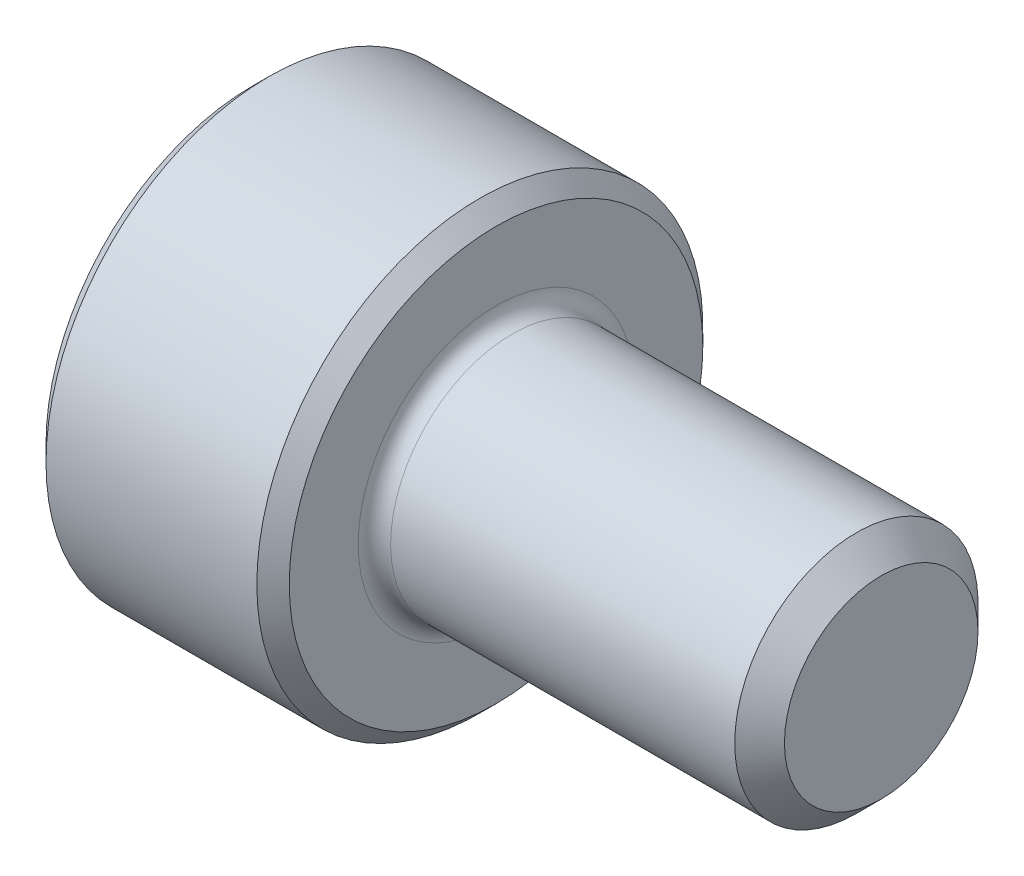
ISO-10303-21;
HEADER;
FILE_DESCRIPTION(('STEP AP214'),'2;1');
FILE_NAME('part.step','',(''),(''),'','','');
FILE_SCHEMA(('AUTOMOTIVE_DESIGN { 1 0 10303 214 1 1 1 1 }'));
ENDSEC;
DATA;
#1=APPLICATION_CONTEXT('core data for automotive mechanical design processes');
#2=APPLICATION_PROTOCOL_DEFINITION('international standard','automotive_design',2000,#1);
#3=PRODUCT_CONTEXT('',#1,'mechanical');
#4=PRODUCT('Part','Part','',(#3));
#5=PRODUCT_RELATED_PRODUCT_CATEGORY('part','',(#4));
#6=PRODUCT_DEFINITION_FORMATION('','',#4);
#7=PRODUCT_DEFINITION_CONTEXT('part definition',#1,'design');
#8=PRODUCT_DEFINITION('design','',#6,#7);
#9=PRODUCT_DEFINITION_SHAPE('','',#8);
#10=(LENGTH_UNIT() NAMED_UNIT(*) SI_UNIT(.MILLI.,.METRE.));
#11=(NAMED_UNIT(*) PLANE_ANGLE_UNIT() SI_UNIT($,.RADIAN.));
#12=(NAMED_UNIT(*) SI_UNIT($,.STERADIAN.) SOLID_ANGLE_UNIT());
#13=UNCERTAINTY_MEASURE_WITH_UNIT(LENGTH_MEASURE(1.E-05),#10,'distance_accuracy_value','');
#14=(GEOMETRIC_REPRESENTATION_CONTEXT(3) GLOBAL_UNCERTAINTY_ASSIGNED_CONTEXT((#13)) GLOBAL_UNIT_ASSIGNED_CONTEXT((#10,
#11,#12)) REPRESENTATION_CONTEXT('',''));
#15=CARTESIAN_POINT('',(0.,0.,0.));
#16=DIRECTION('',(0.,0.,1.));
#17=DIRECTION('',(1.,0.,0.));
#18=AXIS2_PLACEMENT_3D('',#15,#16,#17);
#19=CARTESIAN_POINT('',(7.75,1.1935,0.));
#20=DIRECTION('',(-1.,0.,0.));
#21=DIRECTION('',(0.,0.,1.));
#22=AXIS2_PLACEMENT_3D('',#19,#20,#21);
#23=PLANE('',#22);
#24=CARTESIAN_POINT('',(7.75000000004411,0.,0.));
#25=DIRECTION('',(-1.,0.,0.));
#26=DIRECTION('',(0.,-1.,0.));
#27=AXIS2_PLACEMENT_3D('',#24,#25,#26);
#28=CIRCLE('',#27,1.1934999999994);
#29=CARTESIAN_POINT('',(7.75000000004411,-1.1934999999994,0.));
#30=VERTEX_POINT('',#29);
#31=EDGE_CURVE('E175',#30,#30,#28,.T.);
#32=ORIENTED_EDGE('',*,*,#31,.F.);
#33=EDGE_LOOP('',(#32));
#34=FACE_BOUND('',#33,.T.);
#35=ADVANCED_FACE('F17',(#34),#23,.F.);
#36=CARTESIAN_POINT('',(7.44350000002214,0.,0.));
#37=DIRECTION('',(-1.,0.,0.));
#38=DIRECTION('',(0.,-1.,0.));
#39=AXIS2_PLACEMENT_3D('',#36,#37,#38);
#40=CONICAL_SURFACE('',#39,1.50000000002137,0.785398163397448);
#41=CARTESIAN_POINT('',(7.4435,0.,0.));
#42=DIRECTION('',(-1.,0.,0.));
#43=DIRECTION('',(0.,0.,1.));
#44=AXIS2_PLACEMENT_3D('',#41,#42,#43);
#45=CIRCLE('',#44,1.5);
#46=CARTESIAN_POINT('',(7.4435,0.,1.5));
#47=VERTEX_POINT('',#46);
#48=EDGE_CURVE('E172',#47,#47,#45,.T.);
#49=ORIENTED_EDGE('',*,*,#48,.F.);
#50=EDGE_LOOP('',(#49));
#51=FACE_BOUND('',#50,.T.);
#52=ORIENTED_EDGE('',*,*,#31,.T.);
#53=EDGE_LOOP('',(#52));
#54=FACE_BOUND('',#53,.T.);
#55=ADVANCED_FACE('F186',(#51,#54),#40,.T.);
#56=CARTESIAN_POINT('',(7.75,0.,0.));
#57=DIRECTION('',(-1.,0.,0.));
#58=DIRECTION('',(0.,0.,1.));
#59=AXIS2_PLACEMENT_3D('',#56,#57,#58);
#60=CYLINDRICAL_SURFACE('',#59,1.5);
#61=CARTESIAN_POINT('',(3.2,0.,0.));
#62=DIRECTION('',(-1.,0.,0.));
#63=DIRECTION('',(0.,0.,1.));
#64=AXIS2_PLACEMENT_3D('',#61,#62,#63);
#65=CIRCLE('',#64,1.5);
#66=CARTESIAN_POINT('',(3.2,0.,1.5));
#67=VERTEX_POINT('',#66);
#68=EDGE_CURVE('E151',#67,#67,#65,.F.);
#69=ORIENTED_EDGE('',*,*,#68,.T.);
#70=EDGE_LOOP('',(#69));
#71=FACE_BOUND('',#70,.T.);
#72=ORIENTED_EDGE('',*,*,#48,.T.);
#73=EDGE_LOOP('',(#72));
#74=FACE_BOUND('',#73,.T.);
#75=ADVANCED_FACE('F193',(#71,#74),#60,.T.);
#76=CARTESIAN_POINT('',(1.3,0.,0.));
#77=DIRECTION('',(1.,0.,0.));
#78=DIRECTION('',(0.,0.,-1.));
#79=AXIS2_PLACEMENT_3D('',#76,#77,#78);
#80=PLANE('',#79);
#81=DIRECTION('',(0.,-0.5,-0.866025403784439));
#82=VECTOR('',#81,1.);
#83=CARTESIAN_POINT('',(1.3,0.721687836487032,-1.25));
#84=LINE('',#83,#82);
#85=CARTESIAN_POINT('',(1.3,0.721687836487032,-1.25));
#86=VERTEX_POINT('',#85);
#87=CARTESIAN_POINT('',(1.3,1.44337567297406,0.));
#88=VERTEX_POINT('',#87);
#89=EDGE_CURVE('E150',#86,#88,#84,.F.);
#90=ORIENTED_EDGE('',*,*,#89,.F.);
#91=DIRECTION('',(0.,1.,0.));
#92=VECTOR('',#91,1.);
#93=CARTESIAN_POINT('',(1.3,-0.721687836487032,-1.25));
#94=LINE('',#93,#92);
#95=CARTESIAN_POINT('',(1.3,-0.721687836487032,-1.25));
#96=VERTEX_POINT('',#95);
#97=EDGE_CURVE('E147',#96,#86,#94,.T.);
#98=ORIENTED_EDGE('',*,*,#97,.F.);
#99=DIRECTION('',(0.,-0.5,0.866025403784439));
#100=VECTOR('',#99,1.);
#101=CARTESIAN_POINT('',(1.3,-1.44337567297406,0.));
#102=LINE('',#101,#100);
#103=CARTESIAN_POINT('',(1.3,-1.44337567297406,0.));
#104=VERTEX_POINT('',#103);
#105=EDGE_CURVE('E141',#104,#96,#102,.F.);
#106=ORIENTED_EDGE('',*,*,#105,.F.);
#107=DIRECTION('',(0.,0.5,0.866025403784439));
#108=VECTOR('',#107,1.);
#109=CARTESIAN_POINT('',(1.3,-0.721687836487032,1.25));
#110=LINE('',#109,#108);
#111=CARTESIAN_POINT('',(1.3,-0.721687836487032,1.25));
#112=VERTEX_POINT('',#111);
#113=EDGE_CURVE('E135',#112,#104,#110,.F.);
#114=ORIENTED_EDGE('',*,*,#113,.F.);
#115=DIRECTION('',(0.,1.,0.));
#116=VECTOR('',#115,1.);
#117=CARTESIAN_POINT('',(1.3,0.721687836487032,1.25));
#118=LINE('',#117,#116);
#119=CARTESIAN_POINT('',(1.3,0.721687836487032,1.25));
#120=VERTEX_POINT('',#119);
#121=EDGE_CURVE('E129',#120,#112,#118,.F.);
#122=ORIENTED_EDGE('',*,*,#121,.F.);
#123=DIRECTION('',(0.,0.5,-0.866025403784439));
#124=VECTOR('',#123,1.);
#125=CARTESIAN_POINT('',(1.3,1.44337567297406,0.));
#126=LINE('',#125,#124);
#127=EDGE_CURVE('E121',#88,#120,#126,.F.);
#128=ORIENTED_EDGE('',*,*,#127,.F.);
#129=EDGE_LOOP('',(#90,#98,#106,#114,#122,#128));
#130=FACE_BOUND('',#129,.T.);
#131=ADVANCED_FACE('F158',(#130),#80,.F.);
#132=CARTESIAN_POINT('',(3.2,0.,0.));
#133=DIRECTION('',(-1.,0.,0.));
#134=DIRECTION('',(0.,0.,1.));
#135=AXIS2_PLACEMENT_3D('',#132,#133,#134);
#136=TOROIDAL_SURFACE('',#135,1.7,0.2);
#137=CARTESIAN_POINT('',(3.,0.,0.));
#138=DIRECTION('',(1.,0.,0.));
#139=DIRECTION('',(0.,0.,-1.));
#140=AXIS2_PLACEMENT_3D('',#137,#138,#139);
#141=CIRCLE('',#140,1.7);
#142=CARTESIAN_POINT('',(3.,0.,-1.7));
#143=VERTEX_POINT('',#142);
#144=CARTESIAN_POINT('',(3.,0.,1.7));
#145=VERTEX_POINT('',#144);
#146=EDGE_CURVE('E78',#143,#145,#141,.T.);
#147=ORIENTED_EDGE('',*,*,#146,.T.);
#148=CARTESIAN_POINT('',(3.,0.,0.));
#149=DIRECTION('',(1.,0.,0.));
#150=DIRECTION('',(0.,0.,1.));
#151=AXIS2_PLACEMENT_3D('',#148,#149,#150);
#152=CIRCLE('',#151,1.7);
#153=EDGE_CURVE('E76',#145,#143,#152,.T.);
#154=ORIENTED_EDGE('',*,*,#153,.T.);
#155=EDGE_LOOP('',(#147,#154));
#156=FACE_BOUND('',#155,.T.);
#157=ORIENTED_EDGE('',*,*,#68,.F.);
#158=EDGE_LOOP('',(#157));
#159=FACE_BOUND('',#158,.T.);
#160=ADVANCED_FACE('F80',(#156,#159),#136,.F.);
#161=CARTESIAN_POINT('',(1.3,0.721687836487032,-1.25));
#162=DIRECTION('',(0.,-0.866025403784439,0.5));
#163=DIRECTION('',(0.,-0.5,-0.866025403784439));
#164=AXIS2_PLACEMENT_3D('',#161,#162,#163);
#165=PLANE('',#164);
#166=ORIENTED_EDGE('',*,*,#89,.T.);
#167=DIRECTION('',(1.,0.,0.));
#168=VECTOR('',#167,1.);
#169=CARTESIAN_POINT('',(1.3,1.44337567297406,0.));
#170=LINE('',#169,#168);
#171=CARTESIAN_POINT('',(0.,1.44337567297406,0.));
#172=VERTEX_POINT('',#171);
#173=EDGE_CURVE('E124',#172,#88,#170,.T.);
#174=ORIENTED_EDGE('',*,*,#173,.F.);
#175=DIRECTION('',(0.,-0.5,-0.866025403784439));
#176=VECTOR('',#175,1.);
#177=CARTESIAN_POINT('',(0.,1.44337567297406,0.));
#178=LINE('',#177,#176);
#179=CARTESIAN_POINT('',(0.,0.721687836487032,-1.25));
#180=VERTEX_POINT('',#179);
#181=EDGE_CURVE('E84',#172,#180,#178,.T.);
#182=ORIENTED_EDGE('',*,*,#181,.T.);
#183=DIRECTION('',(1.,0.,0.));
#184=VECTOR('',#183,1.);
#185=CARTESIAN_POINT('',(1.3,0.721687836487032,-1.25));
#186=LINE('',#185,#184);
#187=EDGE_CURVE('E144',#86,#180,#186,.F.);
#188=ORIENTED_EDGE('',*,*,#187,.F.);
#189=EDGE_LOOP('',(#166,#174,#182,#188));
#190=FACE_BOUND('',#189,.T.);
#191=ADVANCED_FACE('F157',(#190),#165,.T.);
#192=CARTESIAN_POINT('',(1.3,-0.721687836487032,-1.25));
#193=DIRECTION('',(0.,0.,1.));
#194=DIRECTION('',(1.,0.,0.));
#195=AXIS2_PLACEMENT_3D('',#192,#193,#194);
#196=PLANE('',#195);
#197=ORIENTED_EDGE('',*,*,#97,.T.);
#198=ORIENTED_EDGE('',*,*,#187,.T.);
#199=DIRECTION('',(0.,1.,0.));
#200=VECTOR('',#199,1.);
#201=CARTESIAN_POINT('',(0.,0.,-1.25));
#202=LINE('',#201,#200);
#203=CARTESIAN_POINT('',(0.,-0.721687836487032,-1.25));
#204=VERTEX_POINT('',#203);
#205=EDGE_CURVE('E225',#180,#204,#202,.F.);
#206=ORIENTED_EDGE('',*,*,#205,.T.);
#207=DIRECTION('',(1.,0.,0.));
#208=VECTOR('',#207,1.);
#209=CARTESIAN_POINT('',(1.3,-0.721687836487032,-1.25));
#210=LINE('',#209,#208);
#211=EDGE_CURVE('E138',#96,#204,#210,.F.);
#212=ORIENTED_EDGE('',*,*,#211,.F.);
#213=EDGE_LOOP('',(#197,#198,#206,#212));
#214=FACE_BOUND('',#213,.T.);
#215=ADVANCED_FACE('F233',(#214),#196,.T.);
#216=CARTESIAN_POINT('',(1.3,-1.44337567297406,0.));
#217=DIRECTION('',(0.,0.866025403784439,0.5));
#218=DIRECTION('',(0.,-0.5,0.866025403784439));
#219=AXIS2_PLACEMENT_3D('',#216,#217,#218);
#220=PLANE('',#219);
#221=ORIENTED_EDGE('',*,*,#105,.T.);
#222=ORIENTED_EDGE('',*,*,#211,.T.);
#223=DIRECTION('',(0.,-0.5,0.866025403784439));
#224=VECTOR('',#223,1.);
#225=CARTESIAN_POINT('',(0.,-0.721687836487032,-1.25));
#226=LINE('',#225,#224);
#227=CARTESIAN_POINT('',(0.,-1.44337567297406,0.));
#228=VERTEX_POINT('',#227);
#229=EDGE_CURVE('E224',#204,#228,#226,.T.);
#230=ORIENTED_EDGE('',*,*,#229,.T.);
#231=DIRECTION('',(1.,0.,0.));
#232=VECTOR('',#231,1.);
#233=CARTESIAN_POINT('',(1.3,-1.44337567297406,0.));
#234=LINE('',#233,#232);
#235=EDGE_CURVE('E132',#104,#228,#234,.F.);
#236=ORIENTED_EDGE('',*,*,#235,.F.);
#237=EDGE_LOOP('',(#221,#222,#230,#236));
#238=FACE_BOUND('',#237,.T.);
#239=ADVANCED_FACE('F239',(#238),#220,.T.);
#240=CARTESIAN_POINT('',(1.3,-0.721687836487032,1.25));
#241=DIRECTION('',(0.,0.866025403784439,-0.5));
#242=DIRECTION('',(0.,0.5,0.866025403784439));
#243=AXIS2_PLACEMENT_3D('',#240,#241,#242);
#244=PLANE('',#243);
#245=ORIENTED_EDGE('',*,*,#113,.T.);
#246=ORIENTED_EDGE('',*,*,#235,.T.);
#247=DIRECTION('',(0.,0.5,0.866025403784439));
#248=VECTOR('',#247,1.);
#249=CARTESIAN_POINT('',(0.,-1.44337567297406,0.));
#250=LINE('',#249,#248);
#251=CARTESIAN_POINT('',(0.,-0.721687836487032,1.25));
#252=VERTEX_POINT('',#251);
#253=EDGE_CURVE('E222',#228,#252,#250,.T.);
#254=ORIENTED_EDGE('',*,*,#253,.T.);
#255=DIRECTION('',(-1.,0.,0.));
#256=VECTOR('',#255,1.);
#257=CARTESIAN_POINT('',(1.3,-0.721687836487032,1.25));
#258=LINE('',#257,#256);
#259=EDGE_CURVE('E127',#112,#252,#258,.T.);
#260=ORIENTED_EDGE('',*,*,#259,.F.);
#261=EDGE_LOOP('',(#245,#246,#254,#260));
#262=FACE_BOUND('',#261,.T.);
#263=ADVANCED_FACE('F241',(#262),#244,.T.);
#264=CARTESIAN_POINT('',(1.3,0.721687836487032,1.25));
#265=DIRECTION('',(0.,0.,-1.));
#266=DIRECTION('',(-1.,0.,0.));
#267=AXIS2_PLACEMENT_3D('',#264,#265,#266);
#268=PLANE('',#267);
#269=ORIENTED_EDGE('',*,*,#121,.T.);
#270=ORIENTED_EDGE('',*,*,#259,.T.);
#271=DIRECTION('',(0.,1.,0.));
#272=VECTOR('',#271,1.);
#273=CARTESIAN_POINT('',(0.,0.,1.25));
#274=LINE('',#273,#272);
#275=CARTESIAN_POINT('',(0.,0.721687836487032,1.25));
#276=VERTEX_POINT('',#275);
#277=EDGE_CURVE('E37',#252,#276,#274,.T.);
#278=ORIENTED_EDGE('',*,*,#277,.T.);
#279=DIRECTION('',(1.,0.,0.));
#280=VECTOR('',#279,1.);
#281=CARTESIAN_POINT('',(1.3,0.721687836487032,1.25));
#282=LINE('',#281,#280);
#283=EDGE_CURVE('E90',#120,#276,#282,.F.);
#284=ORIENTED_EDGE('',*,*,#283,.F.);
#285=EDGE_LOOP('',(#269,#270,#278,#284));
#286=FACE_BOUND('',#285,.T.);
#287=ADVANCED_FACE('F246',(#286),#268,.T.);
#288=CARTESIAN_POINT('',(1.3,1.44337567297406,0.));
#289=DIRECTION('',(0.,-0.866025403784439,-0.5));
#290=DIRECTION('',(0.,0.5,-0.866025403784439));
#291=AXIS2_PLACEMENT_3D('',#288,#289,#290);
#292=PLANE('',#291);
#293=ORIENTED_EDGE('',*,*,#127,.T.);
#294=ORIENTED_EDGE('',*,*,#283,.T.);
#295=DIRECTION('',(0.,0.5,-0.866025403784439));
#296=VECTOR('',#295,1.);
#297=CARTESIAN_POINT('',(0.,0.721687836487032,1.25));
#298=LINE('',#297,#296);
#299=EDGE_CURVE('E182',#276,#172,#298,.T.);
#300=ORIENTED_EDGE('',*,*,#299,.T.);
#301=ORIENTED_EDGE('',*,*,#173,.T.);
#302=EDGE_LOOP('',(#293,#294,#300,#301));
#303=FACE_BOUND('',#302,.T.);
#304=ADVANCED_FACE('F108',(#303),#292,.T.);
#305=CARTESIAN_POINT('',(3.,2.55,0.));
#306=DIRECTION('',(-1.,0.,0.));
#307=DIRECTION('',(0.,0.,1.));
#308=AXIS2_PLACEMENT_3D('',#305,#306,#307);
#309=PLANE('',#308);
#310=ORIENTED_EDGE('',*,*,#153,.F.);
#311=ORIENTED_EDGE('',*,*,#146,.F.);
#312=EDGE_LOOP('',(#310,#311));
#313=FACE_BOUND('',#312,.T.);
#314=CARTESIAN_POINT('',(2.9999999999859,0.,0.));
#315=DIRECTION('',(-1.,0.,0.));
#316=DIRECTION('',(0.,0.,1.));
#317=AXIS2_PLACEMENT_3D('',#314,#315,#316);
#318=CIRCLE('',#317,2.54999999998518);
#319=CARTESIAN_POINT('',(2.9999999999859,0.,2.54999999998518));
#320=VERTEX_POINT('',#319);
#321=EDGE_CURVE('E179',#320,#320,#318,.T.);
#322=ORIENTED_EDGE('',*,*,#321,.F.);
#323=EDGE_LOOP('',(#322));
#324=FACE_BOUND('',#323,.T.);
#325=ADVANCED_FACE('F88',(#313,#324),#309,.F.);
#326=CARTESIAN_POINT('',(0.,0.,0.));
#327=DIRECTION('',(1.,0.,0.));
#328=DIRECTION('',(0.,0.,-1.));
#329=AXIS2_PLACEMENT_3D('',#326,#327,#328);
#330=PLANE('',#329);
#331=ORIENTED_EDGE('',*,*,#277,.F.);
#332=ORIENTED_EDGE('',*,*,#253,.F.);
#333=ORIENTED_EDGE('',*,*,#229,.F.);
#334=ORIENTED_EDGE('',*,*,#205,.F.);
#335=ORIENTED_EDGE('',*,*,#181,.F.);
#336=ORIENTED_EDGE('',*,*,#299,.F.);
#337=EDGE_LOOP('',(#331,#332,#333,#334,#335,#336));
#338=FACE_BOUND('',#337,.T.);
#339=CARTESIAN_POINT('',(5.6843418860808E-11,0.,0.));
#340=DIRECTION('',(1.,0.,0.));
#341=DIRECTION('',(0.,0.,-1.));
#342=AXIS2_PLACEMENT_3D('',#339,#340,#341);
#343=CIRCLE('',#342,2.55000000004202);
#344=CARTESIAN_POINT('',(5.6843418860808E-11,0.,-2.55000000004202));
#345=VERTEX_POINT('',#344);
#346=EDGE_CURVE('E176',#345,#345,#343,.T.);
#347=ORIENTED_EDGE('',*,*,#346,.F.);
#348=EDGE_LOOP('',(#347));
#349=FACE_BOUND('',#348,.T.);
#350=ADVANCED_FACE('F107',(#338,#349),#330,.F.);
#351=CARTESIAN_POINT('',(2.80000000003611,0.,0.));
#352=DIRECTION('',(-1.,0.,0.));
#353=DIRECTION('',(0.,0.,1.));
#354=AXIS2_PLACEMENT_3D('',#351,#352,#353);
#355=CONICAL_SURFACE('',#354,2.74999999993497,0.785398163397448);
#356=CARTESIAN_POINT('',(2.8,0.,0.));
#357=DIRECTION('',(-1.,0.,0.));
#358=DIRECTION('',(0.,0.,1.));
#359=AXIS2_PLACEMENT_3D('',#356,#357,#358);
#360=CIRCLE('',#359,2.75);
#361=CARTESIAN_POINT('',(2.8,0.,2.75));
#362=VERTEX_POINT('',#361);
#363=EDGE_CURVE('E28',#362,#362,#360,.T.);
#364=ORIENTED_EDGE('',*,*,#363,.F.);
#365=EDGE_LOOP('',(#364));
#366=FACE_BOUND('',#365,.T.);
#367=ORIENTED_EDGE('',*,*,#321,.T.);
#368=EDGE_LOOP('',(#367));
#369=FACE_BOUND('',#368,.T.);
#370=ADVANCED_FACE('F203',(#366,#369),#355,.T.);
#371=CARTESIAN_POINT('',(0.200000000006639,0.,0.));
#372=DIRECTION('',(1.,0.,0.));
#373=DIRECTION('',(0.,0.,-1.));
#374=AXIS2_PLACEMENT_3D('',#371,#372,#373);
#375=CONICAL_SURFACE('',#374,2.74999999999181,0.785398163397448);
#376=CARTESIAN_POINT('',(0.2,0.,0.));
#377=DIRECTION('',(-1.,0.,0.));
#378=DIRECTION('',(0.,0.,1.));
#379=AXIS2_PLACEMENT_3D('',#376,#377,#378);
#380=CIRCLE('',#379,2.75);
#381=CARTESIAN_POINT('',(0.2,0.,2.75));
#382=VERTEX_POINT('',#381);
#383=EDGE_CURVE('E11',#382,#382,#380,.F.);
#384=ORIENTED_EDGE('',*,*,#383,.F.);
#385=EDGE_LOOP('',(#384));
#386=FACE_BOUND('',#385,.T.);
#387=ORIENTED_EDGE('',*,*,#346,.T.);
#388=EDGE_LOOP('',(#387));
#389=FACE_BOUND('',#388,.T.);
#390=ADVANCED_FACE('F197',(#386,#389),#375,.T.);
#391=CARTESIAN_POINT('',(7.75,0.,0.));
#392=DIRECTION('',(-1.,0.,0.));
#393=DIRECTION('',(0.,0.,1.));
#394=AXIS2_PLACEMENT_3D('',#391,#392,#393);
#395=CYLINDRICAL_SURFACE('',#394,2.75);
#396=ORIENTED_EDGE('',*,*,#383,.T.);
#397=EDGE_LOOP('',(#396));
#398=FACE_BOUND('',#397,.T.);
#399=ORIENTED_EDGE('',*,*,#363,.T.);
#400=EDGE_LOOP('',(#399));
#401=FACE_BOUND('',#400,.T.);
#402=ADVANCED_FACE('F195',(#398,#401),#395,.T.);
#403=CLOSED_SHELL('',(#35,#55,#75,#131,#160,#191,#215,#239,#263,#287,#304,#325,#350,#370,#390,#402));
#404=MANIFOLD_SOLID_BREP('B1',#403);
#405=ADVANCED_BREP_SHAPE_REPRESENTATION('',(#18,#404),#14);
#406=SHAPE_DEFINITION_REPRESENTATION(#9,#405);
ENDSEC;
END-ISO-10303-21;
